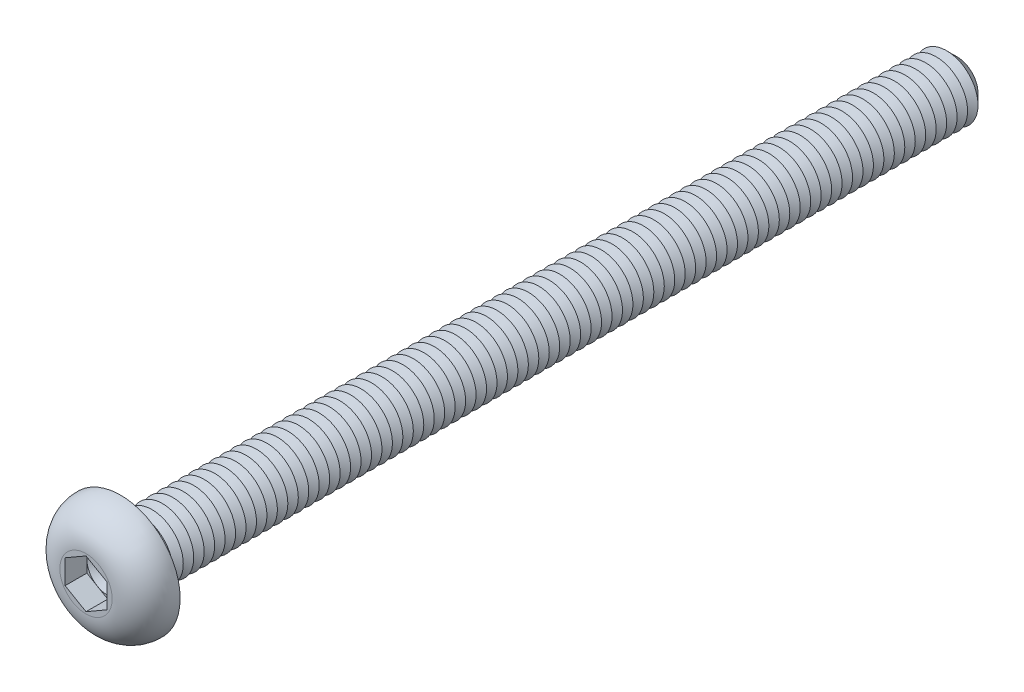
from build123d import *

# Parameters (mm, degrees)
CUT_EXTRUDE1_DEPTH  = 1.04
SKETCH4_R           = 1.5
BOSS_EXTRUDE1_DEPTH = 40
CHAMFER1_SIZE       = 0.5
LPATTERN1_COUNT     = 78
LPATTERN1_PITCH     = 0.5
FILLET2_R           = 0.2


with BuildPart() as part:
    # Sketch2 → Revolve1 (revolve)
    with BuildSketch(Plane(origin=(0, 0, 0), x_dir=(0, 0, -1), z_dir=(1, 0, 0)), mode=Mode.PRIVATE) as revolve1_sk:
        with BuildLine():
            Line((0, 0), (-1.65, 0))
            Line((-1.65, 0), (-1.65, 1.250781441))
            ThreePointArc((-1.65, 1.250781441), (-1.163552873, 2.39969397), (0, 2.85))
            Line((0, 2.85), (0, 0))
        make_face()
    revolve(revolve1_sk.sketch.rotate(Axis((0, 0, 47.934239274), (0, 0, -1)), 90), axis=Axis((0, 0, 47.934239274), (0, 0, -1)))

    # Sketch3 → Cut-Extrude1 (cut)
    with BuildSketch(Plane.XY.offset(1.65)):
        Polygon((0, 1.154700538), (-1, 0.577350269), (-1, -0.577350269), (0, -1.154700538), (1, -0.577350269), (1, 0.577350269), align=None)
    extrude(amount=-CUT_EXTRUDE1_DEPTH, mode=Mode.SUBTRACT)

    # Sketch4 → Boss-Extrude1 (add)
    with BuildSketch(Plane(origin=(0, 0, 0), x_dir=(-1, 0, 0), z_dir=(0, 0, -1))):
        with Locations(Location((0, 0, 0), (0, 0, 180))):
            Circle(SKETCH4_R)
    extrude(amount=BOSS_EXTRUDE1_DEPTH)

    # Chamfer1
    chamfer1_edges = [part.edges().sort_by_distance(p)[0] for p in [
        (-1.5, 0, -40),
    ]]
    chamfer(chamfer1_edges, length=CHAMFER1_SIZE)

    # Sketch5 → Cut-Revolve1 (revolve, cut)
    with BuildSketch(Plane(origin=(0, 0, 0), x_dir=(0, 0, -1), z_dir=(1, 0, 0)), mode=Mode.PRIVATE) as cut_revolve1_sk:
        Polygon((0.5, 1.5), (1, 1.5), (0.75, 1.066987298), align=None)
    cut_revolve1 = revolve(cut_revolve1_sk.sketch.rotate(Axis((0, 0, 47.934239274), (0, 0, -1)), 90), axis=Axis((0, 0, 47.934239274), (0, 0, -1)), mode=Mode.SUBTRACT)

    # LPattern1: Cut-Revolve1 ×78
    with Locations(*[(0, 0, -i * LPATTERN1_PITCH) for i in range(1, LPATTERN1_COUNT)]):
        add(cut_revolve1, mode=Mode.SUBTRACT)

    # Fillet2
    fillet2_edges = [part.edges().sort_by_distance(p)[0] for p in [
        (-1.5, 0, 0),
    ]]
    fillet(fillet2_edges, radius=FILLET2_R)

    # Cut-Extrude2 cone 1 section (on through the dimple's axis) → Cut-Extrude2 (revolve, cut)
    with BuildSketch(Plane(origin=(0, 0, 0.61), x_dir=(0, -1, 0), z_dir=(1, 0, 0))):
        Polygon((0, 0), (1, 0), (0, 0.577350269), align=None)
    revolve(axis=Axis((0, 0, 0.61), (0, 0, -1)), mode=Mode.SUBTRACT)


solid = part.part
